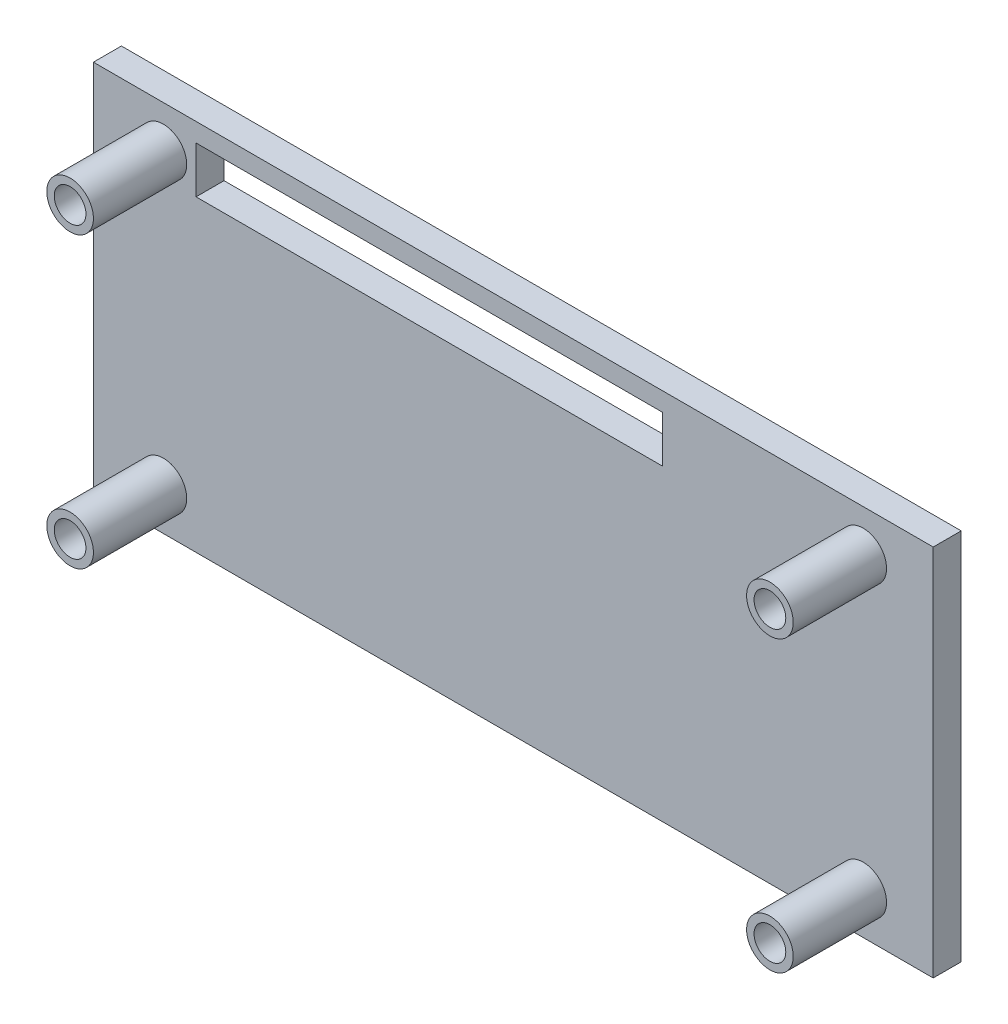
ISO-10303-21;
HEADER;
FILE_DESCRIPTION(('STEP AP214'),'2;1');
FILE_NAME('part.step','',(''),(''),'','','');
FILE_SCHEMA(('AUTOMOTIVE_DESIGN { 1 0 10303 214 1 1 1 1 }'));
ENDSEC;
DATA;
#1=APPLICATION_CONTEXT('core data for automotive mechanical design processes');
#2=APPLICATION_PROTOCOL_DEFINITION('international standard','automotive_design',2000,#1);
#3=PRODUCT_CONTEXT('',#1,'mechanical');
#4=PRODUCT('Part','Part','',(#3));
#5=PRODUCT_RELATED_PRODUCT_CATEGORY('part','',(#4));
#6=PRODUCT_DEFINITION_FORMATION('','',#4);
#7=PRODUCT_DEFINITION_CONTEXT('part definition',#1,'design');
#8=PRODUCT_DEFINITION('design','',#6,#7);
#9=PRODUCT_DEFINITION_SHAPE('','',#8);
#10=(LENGTH_UNIT() NAMED_UNIT(*) SI_UNIT(.MILLI.,.METRE.));
#11=(NAMED_UNIT(*) PLANE_ANGLE_UNIT() SI_UNIT($,.RADIAN.));
#12=(NAMED_UNIT(*) SI_UNIT($,.STERADIAN.) SOLID_ANGLE_UNIT());
#13=UNCERTAINTY_MEASURE_WITH_UNIT(LENGTH_MEASURE(1.E-05),#10,'distance_accuracy_value','');
#14=(GEOMETRIC_REPRESENTATION_CONTEXT(3) GLOBAL_UNCERTAINTY_ASSIGNED_CONTEXT((#13)) GLOBAL_UNIT_ASSIGNED_CONTEXT((#10,
#11,#12)) REPRESENTATION_CONTEXT('',''));
#15=CARTESIAN_POINT('',(0.,0.,0.));
#16=DIRECTION('',(0.,0.,1.));
#17=DIRECTION('',(1.,0.,0.));
#18=AXIS2_PLACEMENT_3D('',#15,#16,#17);
#19=CARTESIAN_POINT('',(45.,20.,3.));
#20=DIRECTION('',(-1.,0.,0.));
#21=DIRECTION('',(0.,-1.,0.));
#22=AXIS2_PLACEMENT_3D('',#19,#20,#21);
#23=PLANE('',#22);
#24=DIRECTION('',(0.,1.,0.));
#25=VECTOR('',#24,1.);
#26=CARTESIAN_POINT('',(45.,20.,0.));
#27=LINE('',#26,#25);
#28=CARTESIAN_POINT('',(45.,-20.,0.));
#29=VERTEX_POINT('',#28);
#30=CARTESIAN_POINT('',(45.,20.,0.));
#31=VERTEX_POINT('',#30);
#32=EDGE_CURVE('E213',#29,#31,#27,.T.);
#33=ORIENTED_EDGE('',*,*,#32,.T.);
#34=DIRECTION('',(0.,0.,-1.));
#35=VECTOR('',#34,1.);
#36=CARTESIAN_POINT('',(45.,20.,3.));
#37=LINE('',#36,#35);
#38=CARTESIAN_POINT('',(45.,20.,3.));
#39=VERTEX_POINT('',#38);
#40=EDGE_CURVE('E11',#39,#31,#37,.T.);
#41=ORIENTED_EDGE('',*,*,#40,.F.);
#42=DIRECTION('',(0.,1.,0.));
#43=VECTOR('',#42,1.);
#44=CARTESIAN_POINT('',(45.,20.,3.));
#45=LINE('',#44,#43);
#46=CARTESIAN_POINT('',(45.,-20.,3.));
#47=VERTEX_POINT('',#46);
#48=EDGE_CURVE('E217',#47,#39,#45,.T.);
#49=ORIENTED_EDGE('',*,*,#48,.F.);
#50=DIRECTION('',(0.,0.,-1.));
#51=VECTOR('',#50,1.);
#52=CARTESIAN_POINT('',(45.,-20.,3.));
#53=LINE('',#52,#51);
#54=EDGE_CURVE('E231',#47,#29,#53,.T.);
#55=ORIENTED_EDGE('',*,*,#54,.T.);
#56=EDGE_LOOP('',(#33,#41,#49,#55));
#57=FACE_BOUND('',#56,.T.);
#58=ADVANCED_FACE('F38',(#57),#23,.F.);
#59=CARTESIAN_POINT('',(-45.,20.,3.));
#60=DIRECTION('',(0.,-1.,0.));
#61=DIRECTION('',(0.,0.,-1.));
#62=AXIS2_PLACEMENT_3D('',#59,#60,#61);
#63=PLANE('',#62);
#64=DIRECTION('',(-1.,0.,0.));
#65=VECTOR('',#64,1.);
#66=CARTESIAN_POINT('',(-45.,20.,0.));
#67=LINE('',#66,#65);
#68=CARTESIAN_POINT('',(-45.,20.,0.));
#69=VERTEX_POINT('',#68);
#70=EDGE_CURVE('E235',#31,#69,#67,.T.);
#71=ORIENTED_EDGE('',*,*,#70,.T.);
#72=DIRECTION('',(0.,0.,-1.));
#73=VECTOR('',#72,1.);
#74=CARTESIAN_POINT('',(-45.,20.,3.));
#75=LINE('',#74,#73);
#76=CARTESIAN_POINT('',(-45.,20.,3.));
#77=VERTEX_POINT('',#76);
#78=EDGE_CURVE('E46',#77,#69,#75,.T.);
#79=ORIENTED_EDGE('',*,*,#78,.F.);
#80=DIRECTION('',(-1.,0.,0.));
#81=VECTOR('',#80,1.);
#82=CARTESIAN_POINT('',(-45.,20.,3.));
#83=LINE('',#82,#81);
#84=EDGE_CURVE('E221',#39,#77,#83,.T.);
#85=ORIENTED_EDGE('',*,*,#84,.F.);
#86=ORIENTED_EDGE('',*,*,#40,.T.);
#87=EDGE_LOOP('',(#71,#79,#85,#86));
#88=FACE_BOUND('',#87,.T.);
#89=ADVANCED_FACE('F271',(#88),#63,.F.);
#90=CARTESIAN_POINT('',(-45.,20.,3.));
#91=DIRECTION('',(1.,0.,0.));
#92=DIRECTION('',(0.,1.,0.));
#93=AXIS2_PLACEMENT_3D('',#90,#91,#92);
#94=PLANE('',#93);
#95=DIRECTION('',(0.,-1.,0.));
#96=VECTOR('',#95,1.);
#97=CARTESIAN_POINT('',(-45.,20.,0.));
#98=LINE('',#97,#96);
#99=CARTESIAN_POINT('',(-45.,-20.,0.));
#100=VERTEX_POINT('',#99);
#101=EDGE_CURVE('E238',#69,#100,#98,.T.);
#102=ORIENTED_EDGE('',*,*,#101,.T.);
#103=DIRECTION('',(0.,0.,-1.));
#104=VECTOR('',#103,1.);
#105=CARTESIAN_POINT('',(-45.,-20.,3.));
#106=LINE('',#105,#104);
#107=CARTESIAN_POINT('',(-45.,-20.,3.));
#108=VERTEX_POINT('',#107);
#109=EDGE_CURVE('E246',#108,#100,#106,.T.);
#110=ORIENTED_EDGE('',*,*,#109,.F.);
#111=DIRECTION('',(0.,-1.,0.));
#112=VECTOR('',#111,1.);
#113=CARTESIAN_POINT('',(-45.,20.,3.));
#114=LINE('',#113,#112);
#115=EDGE_CURVE('E225',#77,#108,#114,.T.);
#116=ORIENTED_EDGE('',*,*,#115,.F.);
#117=ORIENTED_EDGE('',*,*,#78,.T.);
#118=EDGE_LOOP('',(#102,#110,#116,#117));
#119=FACE_BOUND('',#118,.T.);
#120=ADVANCED_FACE('F256',(#119),#94,.F.);
#121=CARTESIAN_POINT('',(-45.,-20.,3.));
#122=DIRECTION('',(0.,1.,0.));
#123=DIRECTION('',(0.,0.,1.));
#124=AXIS2_PLACEMENT_3D('',#121,#122,#123);
#125=PLANE('',#124);
#126=DIRECTION('',(1.,0.,0.));
#127=VECTOR('',#126,1.);
#128=CARTESIAN_POINT('',(-45.,-20.,0.));
#129=LINE('',#128,#127);
#130=EDGE_CURVE('E222',#100,#29,#129,.T.);
#131=ORIENTED_EDGE('',*,*,#130,.T.);
#132=ORIENTED_EDGE('',*,*,#54,.F.);
#133=DIRECTION('',(1.,0.,0.));
#134=VECTOR('',#133,1.);
#135=CARTESIAN_POINT('',(-45.,-20.,3.));
#136=LINE('',#135,#134);
#137=EDGE_CURVE('E228',#108,#47,#136,.T.);
#138=ORIENTED_EDGE('',*,*,#137,.F.);
#139=ORIENTED_EDGE('',*,*,#109,.T.);
#140=EDGE_LOOP('',(#131,#132,#138,#139));
#141=FACE_BOUND('',#140,.T.);
#142=ADVANCED_FACE('F264',(#141),#125,.F.);
#143=CARTESIAN_POINT('',(0.,0.,3.));
#144=DIRECTION('',(0.,0.,1.));
#145=DIRECTION('',(1.,0.,0.));
#146=AXIS2_PLACEMENT_3D('',#143,#144,#145);
#147=PLANE('',#146);
#148=DIRECTION('',(0.,1.,0.));
#149=VECTOR('',#148,1.);
#150=CARTESIAN_POINT('',(16.,18.,3.));
#151=LINE('',#150,#149);
#152=CARTESIAN_POINT('',(16.,13.,3.));
#153=VERTEX_POINT('',#152);
#154=CARTESIAN_POINT('',(16.,18.,3.));
#155=VERTEX_POINT('',#154);
#156=EDGE_CURVE('E53',#153,#155,#151,.T.);
#157=ORIENTED_EDGE('',*,*,#156,.F.);
#158=DIRECTION('',(1.,0.,0.));
#159=VECTOR('',#158,1.);
#160=CARTESIAN_POINT('',(-34.,13.,3.));
#161=LINE('',#160,#159);
#162=CARTESIAN_POINT('',(-34.,13.,3.));
#163=VERTEX_POINT('',#162);
#164=EDGE_CURVE('E124',#163,#153,#161,.T.);
#165=ORIENTED_EDGE('',*,*,#164,.F.);
#166=DIRECTION('',(0.,-1.,0.));
#167=VECTOR('',#166,1.);
#168=CARTESIAN_POINT('',(-34.,18.,3.));
#169=LINE('',#168,#167);
#170=CARTESIAN_POINT('',(-34.,18.,3.));
#171=VERTEX_POINT('',#170);
#172=EDGE_CURVE('E129',#171,#163,#169,.T.);
#173=ORIENTED_EDGE('',*,*,#172,.F.);
#174=DIRECTION('',(-1.,0.,0.));
#175=VECTOR('',#174,1.);
#176=CARTESIAN_POINT('',(-34.,18.,3.));
#177=LINE('',#176,#175);
#178=EDGE_CURVE('E138',#155,#171,#177,.T.);
#179=ORIENTED_EDGE('',*,*,#178,.F.);
#180=EDGE_LOOP('',(#157,#165,#173,#179));
#181=FACE_BOUND('',#180,.T.);
#182=CARTESIAN_POINT('',(37.5,-15.5,3.));
#183=DIRECTION('',(0.,0.,1.));
#184=DIRECTION('',(1.,0.,0.));
#185=AXIS2_PLACEMENT_3D('',#182,#183,#184);
#186=CIRCLE('',#185,2.5);
#187=CARTESIAN_POINT('',(40.,-15.5,3.));
#188=VERTEX_POINT('',#187);
#189=EDGE_CURVE('E185',#188,#188,#186,.T.);
#190=ORIENTED_EDGE('',*,*,#189,.F.);
#191=EDGE_LOOP('',(#190));
#192=FACE_BOUND('',#191,.T.);
#193=CARTESIAN_POINT('',(37.5,15.5,3.));
#194=DIRECTION('',(0.,0.,1.));
#195=DIRECTION('',(1.,0.,0.));
#196=AXIS2_PLACEMENT_3D('',#193,#194,#195);
#197=CIRCLE('',#196,2.5);
#198=CARTESIAN_POINT('',(40.,15.5,3.));
#199=VERTEX_POINT('',#198);
#200=EDGE_CURVE('E193',#199,#199,#197,.T.);
#201=ORIENTED_EDGE('',*,*,#200,.F.);
#202=EDGE_LOOP('',(#201));
#203=FACE_BOUND('',#202,.T.);
#204=CARTESIAN_POINT('',(-37.5,-15.5,3.));
#205=DIRECTION('',(0.,0.,1.));
#206=DIRECTION('',(1.,0.,0.));
#207=AXIS2_PLACEMENT_3D('',#204,#205,#206);
#208=CIRCLE('',#207,2.5);
#209=CARTESIAN_POINT('',(-35.,-15.5,3.));
#210=VERTEX_POINT('',#209);
#211=EDGE_CURVE('E201',#210,#210,#208,.T.);
#212=ORIENTED_EDGE('',*,*,#211,.F.);
#213=EDGE_LOOP('',(#212));
#214=FACE_BOUND('',#213,.T.);
#215=CARTESIAN_POINT('',(-37.5,15.5,3.));
#216=DIRECTION('',(0.,0.,1.));
#217=DIRECTION('',(1.,0.,0.));
#218=AXIS2_PLACEMENT_3D('',#215,#216,#217);
#219=CIRCLE('',#218,2.5);
#220=CARTESIAN_POINT('',(-35.,15.5,3.));
#221=VERTEX_POINT('',#220);
#222=EDGE_CURVE('E205',#221,#221,#219,.T.);
#223=ORIENTED_EDGE('',*,*,#222,.F.);
#224=EDGE_LOOP('',(#223));
#225=FACE_BOUND('',#224,.T.);
#226=ORIENTED_EDGE('',*,*,#48,.T.);
#227=ORIENTED_EDGE('',*,*,#84,.T.);
#228=ORIENTED_EDGE('',*,*,#115,.T.);
#229=ORIENTED_EDGE('',*,*,#137,.T.);
#230=EDGE_LOOP('',(#226,#227,#228,#229));
#231=FACE_BOUND('',#230,.T.);
#232=ADVANCED_FACE('F270',(#181,#192,#203,#214,#225,#231),#147,.T.);
#233=CARTESIAN_POINT('',(0.,0.,0.));
#234=DIRECTION('',(0.,0.,1.));
#235=DIRECTION('',(1.,0.,0.));
#236=AXIS2_PLACEMENT_3D('',#233,#234,#235);
#237=PLANE('',#236);
#238=DIRECTION('',(1.,0.,0.));
#239=VECTOR('',#238,1.);
#240=CARTESIAN_POINT('',(-34.,13.,0.));
#241=LINE('',#240,#239);
#242=CARTESIAN_POINT('',(-34.,13.,0.));
#243=VERTEX_POINT('',#242);
#244=CARTESIAN_POINT('',(16.,13.,0.));
#245=VERTEX_POINT('',#244);
#246=EDGE_CURVE('E112',#243,#245,#241,.T.);
#247=ORIENTED_EDGE('',*,*,#246,.T.);
#248=DIRECTION('',(0.,1.,0.));
#249=VECTOR('',#248,1.);
#250=CARTESIAN_POINT('',(16.,18.,0.));
#251=LINE('',#250,#249);
#252=CARTESIAN_POINT('',(16.,18.,0.));
#253=VERTEX_POINT('',#252);
#254=EDGE_CURVE('E105',#245,#253,#251,.T.);
#255=ORIENTED_EDGE('',*,*,#254,.T.);
#256=DIRECTION('',(-1.,0.,0.));
#257=VECTOR('',#256,1.);
#258=CARTESIAN_POINT('',(-34.,18.,0.));
#259=LINE('',#258,#257);
#260=CARTESIAN_POINT('',(-34.,18.,0.));
#261=VERTEX_POINT('',#260);
#262=EDGE_CURVE('E115',#253,#261,#259,.T.);
#263=ORIENTED_EDGE('',*,*,#262,.T.);
#264=DIRECTION('',(0.,-1.,0.));
#265=VECTOR('',#264,1.);
#266=CARTESIAN_POINT('',(-34.,18.,0.));
#267=LINE('',#266,#265);
#268=EDGE_CURVE('E61',#261,#243,#267,.T.);
#269=ORIENTED_EDGE('',*,*,#268,.T.);
#270=EDGE_LOOP('',(#247,#255,#263,#269));
#271=FACE_BOUND('',#270,.T.);
#272=CARTESIAN_POINT('',(-37.5,15.5,0.));
#273=DIRECTION('',(0.,0.,1.));
#274=DIRECTION('',(1.,0.,0.));
#275=AXIS2_PLACEMENT_3D('',#272,#273,#274);
#276=CIRCLE('',#275,1.7);
#277=CARTESIAN_POINT('',(-35.8,15.5,0.));
#278=VERTEX_POINT('',#277);
#279=EDGE_CURVE('E156',#278,#278,#276,.T.);
#280=ORIENTED_EDGE('',*,*,#279,.T.);
#281=EDGE_LOOP('',(#280));
#282=FACE_BOUND('',#281,.T.);
#283=CARTESIAN_POINT('',(-37.5,-15.5,0.));
#284=DIRECTION('',(0.,0.,1.));
#285=DIRECTION('',(1.,0.,0.));
#286=AXIS2_PLACEMENT_3D('',#283,#284,#285);
#287=CIRCLE('',#286,1.7);
#288=CARTESIAN_POINT('',(-35.8,-15.5,0.));
#289=VERTEX_POINT('',#288);
#290=EDGE_CURVE('E164',#289,#289,#287,.T.);
#291=ORIENTED_EDGE('',*,*,#290,.T.);
#292=EDGE_LOOP('',(#291));
#293=FACE_BOUND('',#292,.T.);
#294=CARTESIAN_POINT('',(37.5,15.5,0.));
#295=DIRECTION('',(0.,0.,1.));
#296=DIRECTION('',(1.,0.,0.));
#297=AXIS2_PLACEMENT_3D('',#294,#295,#296);
#298=CIRCLE('',#297,1.7);
#299=CARTESIAN_POINT('',(39.2,15.5,0.));
#300=VERTEX_POINT('',#299);
#301=EDGE_CURVE('E172',#300,#300,#298,.T.);
#302=ORIENTED_EDGE('',*,*,#301,.T.);
#303=EDGE_LOOP('',(#302));
#304=FACE_BOUND('',#303,.T.);
#305=CARTESIAN_POINT('',(37.5,-15.5,0.));
#306=DIRECTION('',(0.,0.,1.));
#307=DIRECTION('',(1.,0.,0.));
#308=AXIS2_PLACEMENT_3D('',#305,#306,#307);
#309=CIRCLE('',#308,1.7);
#310=CARTESIAN_POINT('',(39.2,-15.5,0.));
#311=VERTEX_POINT('',#310);
#312=EDGE_CURVE('E180',#311,#311,#309,.T.);
#313=ORIENTED_EDGE('',*,*,#312,.T.);
#314=EDGE_LOOP('',(#313));
#315=FACE_BOUND('',#314,.T.);
#316=ORIENTED_EDGE('',*,*,#32,.F.);
#317=ORIENTED_EDGE('',*,*,#130,.F.);
#318=ORIENTED_EDGE('',*,*,#101,.F.);
#319=ORIENTED_EDGE('',*,*,#70,.F.);
#320=EDGE_LOOP('',(#316,#317,#318,#319));
#321=FACE_BOUND('',#320,.T.);
#322=ADVANCED_FACE('F120',(#271,#282,#293,#304,#315,#321),#237,.F.);
#323=CARTESIAN_POINT('',(-37.5,15.5,13.));
#324=DIRECTION('',(0.,0.,-1.));
#325=DIRECTION('',(-1.,0.,0.));
#326=AXIS2_PLACEMENT_3D('',#323,#324,#325);
#327=CYLINDRICAL_SURFACE('',#326,2.5);
#328=CARTESIAN_POINT('',(-37.5,15.5,13.));
#329=DIRECTION('',(0.,0.,1.));
#330=DIRECTION('',(1.,0.,0.));
#331=AXIS2_PLACEMENT_3D('',#328,#329,#330);
#332=CIRCLE('',#331,2.5);
#333=CARTESIAN_POINT('',(-35.,15.5,13.));
#334=VERTEX_POINT('',#333);
#335=EDGE_CURVE('E209',#334,#334,#332,.T.);
#336=ORIENTED_EDGE('',*,*,#335,.F.);
#337=EDGE_LOOP('',(#336));
#338=FACE_BOUND('',#337,.T.);
#339=ORIENTED_EDGE('',*,*,#222,.T.);
#340=EDGE_LOOP('',(#339));
#341=FACE_BOUND('',#340,.T.);
#342=ADVANCED_FACE('F283',(#338,#341),#327,.T.);
#343=CARTESIAN_POINT('',(-37.5,15.5,13.));
#344=DIRECTION('',(0.,0.,1.));
#345=DIRECTION('',(1.,0.,0.));
#346=AXIS2_PLACEMENT_3D('',#343,#344,#345);
#347=PLANE('',#346);
#348=CARTESIAN_POINT('',(-37.5,15.5,13.));
#349=DIRECTION('',(0.,0.,1.));
#350=DIRECTION('',(1.,0.,0.));
#351=AXIS2_PLACEMENT_3D('',#348,#349,#350);
#352=CIRCLE('',#351,1.69999999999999);
#353=CARTESIAN_POINT('',(-35.8,15.5,13.));
#354=VERTEX_POINT('',#353);
#355=EDGE_CURVE('E147',#354,#354,#352,.T.);
#356=ORIENTED_EDGE('',*,*,#355,.F.);
#357=EDGE_LOOP('',(#356));
#358=FACE_BOUND('',#357,.T.);
#359=ORIENTED_EDGE('',*,*,#335,.T.);
#360=EDGE_LOOP('',(#359));
#361=FACE_BOUND('',#360,.T.);
#362=ADVANCED_FACE('F289',(#358,#361),#347,.T.);
#363=CARTESIAN_POINT('',(-37.5,-15.5,13.));
#364=DIRECTION('',(0.,0.,-1.));
#365=DIRECTION('',(-1.,0.,0.));
#366=AXIS2_PLACEMENT_3D('',#363,#364,#365);
#367=CYLINDRICAL_SURFACE('',#366,2.5);
#368=CARTESIAN_POINT('',(-37.5,-15.5,13.));
#369=DIRECTION('',(0.,0.,1.));
#370=DIRECTION('',(1.,0.,0.));
#371=AXIS2_PLACEMENT_3D('',#368,#369,#370);
#372=CIRCLE('',#371,2.5);
#373=CARTESIAN_POINT('',(-35.,-15.5,13.));
#374=VERTEX_POINT('',#373);
#375=EDGE_CURVE('E197',#374,#374,#372,.T.);
#376=ORIENTED_EDGE('',*,*,#375,.F.);
#377=EDGE_LOOP('',(#376));
#378=FACE_BOUND('',#377,.T.);
#379=ORIENTED_EDGE('',*,*,#211,.T.);
#380=EDGE_LOOP('',(#379));
#381=FACE_BOUND('',#380,.T.);
#382=ADVANCED_FACE('F293',(#378,#381),#367,.T.);
#383=CARTESIAN_POINT('',(-37.5,-15.5,13.));
#384=DIRECTION('',(0.,0.,1.));
#385=DIRECTION('',(1.,0.,0.));
#386=AXIS2_PLACEMENT_3D('',#383,#384,#385);
#387=PLANE('',#386);
#388=CARTESIAN_POINT('',(-37.5,-15.5,13.));
#389=DIRECTION('',(0.,0.,1.));
#390=DIRECTION('',(1.,0.,0.));
#391=AXIS2_PLACEMENT_3D('',#388,#389,#390);
#392=CIRCLE('',#391,1.69999999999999);
#393=CARTESIAN_POINT('',(-35.8,-15.5,13.));
#394=VERTEX_POINT('',#393);
#395=EDGE_CURVE('E160',#394,#394,#392,.T.);
#396=ORIENTED_EDGE('',*,*,#395,.F.);
#397=EDGE_LOOP('',(#396));
#398=FACE_BOUND('',#397,.T.);
#399=ORIENTED_EDGE('',*,*,#375,.T.);
#400=EDGE_LOOP('',(#399));
#401=FACE_BOUND('',#400,.T.);
#402=ADVANCED_FACE('F295',(#398,#401),#387,.T.);
#403=CARTESIAN_POINT('',(37.5,15.5,13.));
#404=DIRECTION('',(0.,0.,-1.));
#405=DIRECTION('',(-1.,0.,0.));
#406=AXIS2_PLACEMENT_3D('',#403,#404,#405);
#407=CYLINDRICAL_SURFACE('',#406,2.5);
#408=CARTESIAN_POINT('',(37.5,15.5,13.));
#409=DIRECTION('',(0.,0.,1.));
#410=DIRECTION('',(1.,0.,0.));
#411=AXIS2_PLACEMENT_3D('',#408,#409,#410);
#412=CIRCLE('',#411,2.5);
#413=CARTESIAN_POINT('',(40.,15.5,13.));
#414=VERTEX_POINT('',#413);
#415=EDGE_CURVE('E189',#414,#414,#412,.T.);
#416=ORIENTED_EDGE('',*,*,#415,.F.);
#417=EDGE_LOOP('',(#416));
#418=FACE_BOUND('',#417,.T.);
#419=ORIENTED_EDGE('',*,*,#200,.T.);
#420=EDGE_LOOP('',(#419));
#421=FACE_BOUND('',#420,.T.);
#422=ADVANCED_FACE('F298',(#418,#421),#407,.T.);
#423=CARTESIAN_POINT('',(37.5,15.5,13.));
#424=DIRECTION('',(0.,0.,1.));
#425=DIRECTION('',(1.,0.,0.));
#426=AXIS2_PLACEMENT_3D('',#423,#424,#425);
#427=PLANE('',#426);
#428=CARTESIAN_POINT('',(37.5,15.5,13.));
#429=DIRECTION('',(0.,0.,1.));
#430=DIRECTION('',(1.,0.,0.));
#431=AXIS2_PLACEMENT_3D('',#428,#429,#430);
#432=CIRCLE('',#431,1.69999999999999);
#433=CARTESIAN_POINT('',(39.2,15.5,13.));
#434=VERTEX_POINT('',#433);
#435=EDGE_CURVE('E168',#434,#434,#432,.T.);
#436=ORIENTED_EDGE('',*,*,#435,.F.);
#437=EDGE_LOOP('',(#436));
#438=FACE_BOUND('',#437,.T.);
#439=ORIENTED_EDGE('',*,*,#415,.T.);
#440=EDGE_LOOP('',(#439));
#441=FACE_BOUND('',#440,.T.);
#442=ADVANCED_FACE('F303',(#438,#441),#427,.T.);
#443=CARTESIAN_POINT('',(37.5,-15.5,13.));
#444=DIRECTION('',(0.,0.,-1.));
#445=DIRECTION('',(-1.,0.,0.));
#446=AXIS2_PLACEMENT_3D('',#443,#444,#445);
#447=CYLINDRICAL_SURFACE('',#446,2.5);
#448=CARTESIAN_POINT('',(37.5,-15.5,13.));
#449=DIRECTION('',(0.,0.,1.));
#450=DIRECTION('',(1.,0.,0.));
#451=AXIS2_PLACEMENT_3D('',#448,#449,#450);
#452=CIRCLE('',#451,2.5);
#453=CARTESIAN_POINT('',(40.,-15.5,13.));
#454=VERTEX_POINT('',#453);
#455=EDGE_CURVE('E184',#454,#454,#452,.T.);
#456=ORIENTED_EDGE('',*,*,#455,.F.);
#457=EDGE_LOOP('',(#456));
#458=FACE_BOUND('',#457,.T.);
#459=ORIENTED_EDGE('',*,*,#189,.T.);
#460=EDGE_LOOP('',(#459));
#461=FACE_BOUND('',#460,.T.);
#462=ADVANCED_FACE('F306',(#458,#461),#447,.T.);
#463=CARTESIAN_POINT('',(37.5,-15.5,13.));
#464=DIRECTION('',(0.,0.,1.));
#465=DIRECTION('',(1.,0.,0.));
#466=AXIS2_PLACEMENT_3D('',#463,#464,#465);
#467=PLANE('',#466);
#468=CARTESIAN_POINT('',(37.5,-15.5,13.));
#469=DIRECTION('',(0.,0.,1.));
#470=DIRECTION('',(1.,0.,0.));
#471=AXIS2_PLACEMENT_3D('',#468,#469,#470);
#472=CIRCLE('',#471,1.69999999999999);
#473=CARTESIAN_POINT('',(39.2,-15.5,13.));
#474=VERTEX_POINT('',#473);
#475=EDGE_CURVE('E176',#474,#474,#472,.T.);
#476=ORIENTED_EDGE('',*,*,#475,.F.);
#477=EDGE_LOOP('',(#476));
#478=FACE_BOUND('',#477,.T.);
#479=ORIENTED_EDGE('',*,*,#455,.T.);
#480=EDGE_LOOP('',(#479));
#481=FACE_BOUND('',#480,.T.);
#482=ADVANCED_FACE('F311',(#478,#481),#467,.T.);
#483=CARTESIAN_POINT('',(37.5,-15.5,13.));
#484=DIRECTION('',(0.,0.,1.));
#485=DIRECTION('',(1.,0.,0.));
#486=AXIS2_PLACEMENT_3D('',#483,#484,#485);
#487=CYLINDRICAL_SURFACE('',#486,1.69999999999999);
#488=ORIENTED_EDGE('',*,*,#312,.F.);
#489=EDGE_LOOP('',(#488));
#490=FACE_BOUND('',#489,.T.);
#491=ORIENTED_EDGE('',*,*,#475,.T.);
#492=EDGE_LOOP('',(#491));
#493=FACE_BOUND('',#492,.T.);
#494=ADVANCED_FACE('F314',(#490,#493),#487,.F.);
#495=CARTESIAN_POINT('',(37.5,15.5,13.));
#496=DIRECTION('',(0.,0.,1.));
#497=DIRECTION('',(1.,0.,0.));
#498=AXIS2_PLACEMENT_3D('',#495,#496,#497);
#499=CYLINDRICAL_SURFACE('',#498,1.69999999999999);
#500=ORIENTED_EDGE('',*,*,#301,.F.);
#501=EDGE_LOOP('',(#500));
#502=FACE_BOUND('',#501,.T.);
#503=ORIENTED_EDGE('',*,*,#435,.T.);
#504=EDGE_LOOP('',(#503));
#505=FACE_BOUND('',#504,.T.);
#506=ADVANCED_FACE('F321',(#502,#505),#499,.F.);
#507=CARTESIAN_POINT('',(-37.5,-15.5,13.));
#508=DIRECTION('',(0.,0.,1.));
#509=DIRECTION('',(1.,0.,0.));
#510=AXIS2_PLACEMENT_3D('',#507,#508,#509);
#511=CYLINDRICAL_SURFACE('',#510,1.69999999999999);
#512=ORIENTED_EDGE('',*,*,#290,.F.);
#513=EDGE_LOOP('',(#512));
#514=FACE_BOUND('',#513,.T.);
#515=ORIENTED_EDGE('',*,*,#395,.T.);
#516=EDGE_LOOP('',(#515));
#517=FACE_BOUND('',#516,.T.);
#518=ADVANCED_FACE('F325',(#514,#517),#511,.F.);
#519=CARTESIAN_POINT('',(-37.5,15.5,13.));
#520=DIRECTION('',(0.,0.,1.));
#521=DIRECTION('',(1.,0.,0.));
#522=AXIS2_PLACEMENT_3D('',#519,#520,#521);
#523=CYLINDRICAL_SURFACE('',#522,1.69999999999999);
#524=ORIENTED_EDGE('',*,*,#279,.F.);
#525=EDGE_LOOP('',(#524));
#526=FACE_BOUND('',#525,.T.);
#527=ORIENTED_EDGE('',*,*,#355,.T.);
#528=EDGE_LOOP('',(#527));
#529=FACE_BOUND('',#528,.T.);
#530=ADVANCED_FACE('F329',(#526,#529),#523,.F.);
#531=CARTESIAN_POINT('',(16.,18.,0.));
#532=DIRECTION('',(1.,0.,0.));
#533=DIRECTION('',(0.,0.,-1.));
#534=AXIS2_PLACEMENT_3D('',#531,#532,#533);
#535=PLANE('',#534);
#536=ORIENTED_EDGE('',*,*,#156,.T.);
#537=DIRECTION('',(0.,0.,1.));
#538=VECTOR('',#537,1.);
#539=CARTESIAN_POINT('',(16.,18.,0.));
#540=LINE('',#539,#538);
#541=EDGE_CURVE('E101',#253,#155,#540,.T.);
#542=ORIENTED_EDGE('',*,*,#541,.F.);
#543=ORIENTED_EDGE('',*,*,#254,.F.);
#544=DIRECTION('',(0.,0.,1.));
#545=VECTOR('',#544,1.);
#546=CARTESIAN_POINT('',(16.,13.,0.));
#547=LINE('',#546,#545);
#548=EDGE_CURVE('E144',#245,#153,#547,.T.);
#549=ORIENTED_EDGE('',*,*,#548,.T.);
#550=EDGE_LOOP('',(#536,#542,#543,#549));
#551=FACE_BOUND('',#550,.T.);
#552=ADVANCED_FACE('F103',(#551),#535,.F.);
#553=CARTESIAN_POINT('',(-34.,13.,0.));
#554=DIRECTION('',(0.,-1.,0.));
#555=DIRECTION('',(0.,0.,-1.));
#556=AXIS2_PLACEMENT_3D('',#553,#554,#555);
#557=PLANE('',#556);
#558=ORIENTED_EDGE('',*,*,#164,.T.);
#559=ORIENTED_EDGE('',*,*,#548,.F.);
#560=ORIENTED_EDGE('',*,*,#246,.F.);
#561=DIRECTION('',(0.,0.,1.));
#562=VECTOR('',#561,1.);
#563=CARTESIAN_POINT('',(-34.,13.,0.));
#564=LINE('',#563,#562);
#565=EDGE_CURVE('E148',#243,#163,#564,.T.);
#566=ORIENTED_EDGE('',*,*,#565,.T.);
#567=EDGE_LOOP('',(#558,#559,#560,#566));
#568=FACE_BOUND('',#567,.T.);
#569=ADVANCED_FACE('F336',(#568),#557,.F.);
#570=CARTESIAN_POINT('',(-34.,18.,0.));
#571=DIRECTION('',(-1.,0.,0.));
#572=DIRECTION('',(0.,-1.,0.));
#573=AXIS2_PLACEMENT_3D('',#570,#571,#572);
#574=PLANE('',#573);
#575=ORIENTED_EDGE('',*,*,#172,.T.);
#576=ORIENTED_EDGE('',*,*,#565,.F.);
#577=ORIENTED_EDGE('',*,*,#268,.F.);
#578=DIRECTION('',(0.,0.,1.));
#579=VECTOR('',#578,1.);
#580=CARTESIAN_POINT('',(-34.,18.,0.));
#581=LINE('',#580,#579);
#582=EDGE_CURVE('E111',#261,#171,#581,.T.);
#583=ORIENTED_EDGE('',*,*,#582,.T.);
#584=EDGE_LOOP('',(#575,#576,#577,#583));
#585=FACE_BOUND('',#584,.T.);
#586=ADVANCED_FACE('F339',(#585),#574,.F.);
#587=CARTESIAN_POINT('',(-34.,18.,0.));
#588=DIRECTION('',(0.,1.,0.));
#589=DIRECTION('',(0.,0.,1.));
#590=AXIS2_PLACEMENT_3D('',#587,#588,#589);
#591=PLANE('',#590);
#592=ORIENTED_EDGE('',*,*,#178,.T.);
#593=ORIENTED_EDGE('',*,*,#582,.F.);
#594=ORIENTED_EDGE('',*,*,#262,.F.);
#595=ORIENTED_EDGE('',*,*,#541,.T.);
#596=EDGE_LOOP('',(#592,#593,#594,#595));
#597=FACE_BOUND('',#596,.T.);
#598=ADVANCED_FACE('F116',(#597),#591,.F.);
#599=CLOSED_SHELL('',(#58,#89,#120,#142,#232,#322,#342,#362,#382,#402,#422,#442,#462,#482,#494,
#506,#518,#530,#552,#569,#586,#598));
#600=MANIFOLD_SOLID_BREP('B2',#599);
#601=ADVANCED_BREP_SHAPE_REPRESENTATION('',(#18,#600),#14);
#602=SHAPE_DEFINITION_REPRESENTATION(#9,#601);
ENDSEC;
END-ISO-10303-21;
